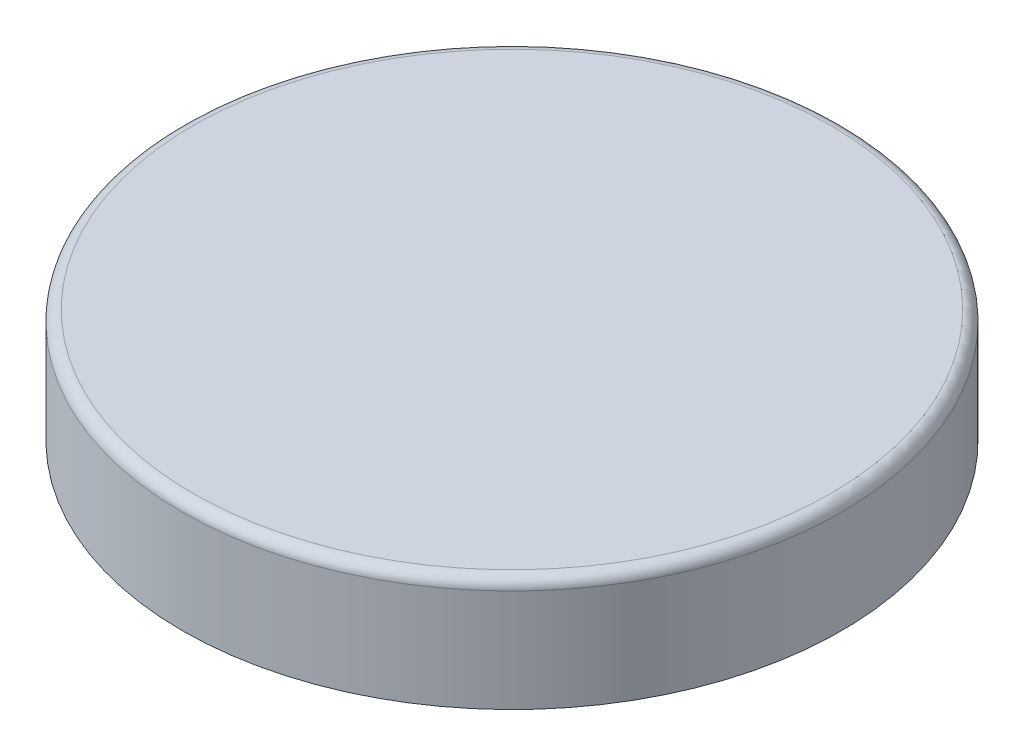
ISO-10303-21;
HEADER;
FILE_DESCRIPTION(('STEP AP214'),'2;1');
FILE_NAME('part.step','',(''),(''),'','','');
FILE_SCHEMA(('AUTOMOTIVE_DESIGN { 1 0 10303 214 1 1 1 1 }'));
ENDSEC;
DATA;
#1=APPLICATION_CONTEXT('core data for automotive mechanical design processes');
#2=APPLICATION_PROTOCOL_DEFINITION('international standard','automotive_design',2000,#1);
#3=PRODUCT_CONTEXT('',#1,'mechanical');
#4=PRODUCT('Part','Part','',(#3));
#5=PRODUCT_RELATED_PRODUCT_CATEGORY('part','',(#4));
#6=PRODUCT_DEFINITION_FORMATION('','',#4);
#7=PRODUCT_DEFINITION_CONTEXT('part definition',#1,'design');
#8=PRODUCT_DEFINITION('design','',#6,#7);
#9=PRODUCT_DEFINITION_SHAPE('','',#8);
#10=(LENGTH_UNIT() NAMED_UNIT(*) SI_UNIT(.MILLI.,.METRE.));
#11=(NAMED_UNIT(*) PLANE_ANGLE_UNIT() SI_UNIT($,.RADIAN.));
#12=(NAMED_UNIT(*) SI_UNIT($,.STERADIAN.) SOLID_ANGLE_UNIT());
#13=UNCERTAINTY_MEASURE_WITH_UNIT(LENGTH_MEASURE(1.E-05),#10,'distance_accuracy_value','');
#14=(GEOMETRIC_REPRESENTATION_CONTEXT(3) GLOBAL_UNCERTAINTY_ASSIGNED_CONTEXT((#13)) GLOBAL_UNIT_ASSIGNED_CONTEXT((#10,
#11,#12)) REPRESENTATION_CONTEXT('',''));
#15=CARTESIAN_POINT('',(0.,0.,0.));
#16=DIRECTION('',(0.,0.,1.));
#17=DIRECTION('',(1.,0.,0.));
#18=AXIS2_PLACEMENT_3D('',#15,#16,#17);
#19=CARTESIAN_POINT('',(0.,11.75,0.));
#20=DIRECTION('',(0.,-1.,0.));
#21=DIRECTION('',(0.,0.,-1.));
#22=AXIS2_PLACEMENT_3D('',#19,#20,#21);
#23=CONICAL_SURFACE('',#22,1.5,1.0471975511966);
#24=CARTESIAN_POINT('',(0.,11.75,0.));
#25=DIRECTION('',(0.,-1.,0.));
#26=DIRECTION('',(0.,0.,-1.));
#27=AXIS2_PLACEMENT_3D('',#24,#25,#26);
#28=CIRCLE('',#27,1.5);
#29=CARTESIAN_POINT('',(0.,11.75,-1.5));
#30=VERTEX_POINT('',#29);
#31=EDGE_CURVE('E76',#30,#30,#28,.T.);
#32=ORIENTED_EDGE('',*,*,#31,.T.);
#33=EDGE_LOOP('',(#32));
#34=FACE_BOUND('',#33,.T.);
#35=CARTESIAN_POINT('',(0.,11.525,0.));
#36=DIRECTION('',(0.,-1.,0.));
#37=DIRECTION('',(0.,0.,-1.));
#38=AXIS2_PLACEMENT_3D('',#35,#36,#37);
#39=CIRCLE('',#38,1.889711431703);
#40=CARTESIAN_POINT('',(0.,11.525,-1.889711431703));
#41=VERTEX_POINT('',#40);
#42=EDGE_CURVE('E73',#41,#41,#39,.T.);
#43=ORIENTED_EDGE('',*,*,#42,.F.);
#44=EDGE_LOOP('',(#43));
#45=FACE_BOUND('',#44,.T.);
#46=ADVANCED_FACE('F39',(#34,#45),#23,.T.);
#47=CARTESIAN_POINT('',(0.,12.0386751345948,0.));
#48=DIRECTION('',(0.,1.,0.));
#49=DIRECTION('',(0.,0.,1.));
#50=AXIS2_PLACEMENT_3D('',#47,#48,#49);
#51=CONICAL_SURFACE('',#50,2.,1.0471975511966);
#52=CARTESIAN_POINT('',(0.,11.975,0.));
#53=DIRECTION('',(0.,-1.,0.));
#54=DIRECTION('',(0.,0.,-1.));
#55=AXIS2_PLACEMENT_3D('',#52,#53,#54);
#56=CIRCLE('',#55,1.889711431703);
#57=CARTESIAN_POINT('',(0.,11.975,-1.889711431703));
#58=VERTEX_POINT('',#57);
#59=EDGE_CURVE('E77',#58,#58,#56,.T.);
#60=ORIENTED_EDGE('',*,*,#59,.T.);
#61=EDGE_LOOP('',(#60));
#62=FACE_BOUND('',#61,.T.);
#63=ORIENTED_EDGE('',*,*,#31,.F.);
#64=EDGE_LOOP('',(#63));
#65=FACE_BOUND('',#64,.T.);
#66=ADVANCED_FACE('F226',(#62,#65),#51,.T.);
#67=CARTESIAN_POINT('',(0.,9.5,0.));
#68=DIRECTION('',(0.,-1.,0.));
#69=DIRECTION('',(0.,0.,-1.));
#70=AXIS2_PLACEMENT_3D('',#67,#68,#69);
#71=PLANE('',#70);
#72=CARTESIAN_POINT('',(0.,9.5,0.));
#73=DIRECTION('',(0.,-1.,0.));
#74=DIRECTION('',(0.,0.,-1.));
#75=AXIS2_PLACEMENT_3D('',#72,#73,#74);
#76=CIRCLE('',#75,1.5);
#77=CARTESIAN_POINT('',(0.,9.5,-1.5));
#78=VERTEX_POINT('',#77);
#79=EDGE_CURVE('E59',#78,#78,#76,.T.);
#80=ORIENTED_EDGE('',*,*,#79,.T.);
#81=EDGE_LOOP('',(#80));
#82=FACE_BOUND('',#81,.T.);
#83=ADVANCED_FACE('F233',(#82),#71,.T.);
#84=CARTESIAN_POINT('',(0.,9.78867513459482,0.));
#85=DIRECTION('',(0.,1.,0.));
#86=DIRECTION('',(0.,0.,1.));
#87=AXIS2_PLACEMENT_3D('',#84,#85,#86);
#88=CONICAL_SURFACE('',#87,2.,1.0471975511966);
#89=CARTESIAN_POINT('',(0.,9.725,0.));
#90=DIRECTION('',(0.,-1.,0.));
#91=DIRECTION('',(0.,0.,-1.));
#92=AXIS2_PLACEMENT_3D('',#89,#90,#91);
#93=CIRCLE('',#92,1.889711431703);
#94=CARTESIAN_POINT('',(0.,9.725,-1.889711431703));
#95=VERTEX_POINT('',#94);
#96=EDGE_CURVE('E56',#95,#95,#93,.T.);
#97=ORIENTED_EDGE('',*,*,#96,.T.);
#98=EDGE_LOOP('',(#97));
#99=FACE_BOUND('',#98,.T.);
#100=ORIENTED_EDGE('',*,*,#79,.F.);
#101=EDGE_LOOP('',(#100));
#102=FACE_BOUND('',#101,.T.);
#103=ADVANCED_FACE('F271',(#99,#102),#88,.T.);
#104=CARTESIAN_POINT('',(0.,9.95,0.));
#105=DIRECTION('',(0.,-1.,0.));
#106=DIRECTION('',(0.,0.,-1.));
#107=AXIS2_PLACEMENT_3D('',#104,#105,#106);
#108=CONICAL_SURFACE('',#107,1.5,1.0471975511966);
#109=CARTESIAN_POINT('',(0.,9.95,0.));
#110=DIRECTION('',(0.,-1.,0.));
#111=DIRECTION('',(0.,0.,-1.));
#112=AXIS2_PLACEMENT_3D('',#109,#110,#111);
#113=CIRCLE('',#112,1.5);
#114=CARTESIAN_POINT('',(0.,9.95,-1.5));
#115=VERTEX_POINT('',#114);
#116=EDGE_CURVE('E60',#115,#115,#113,.T.);
#117=ORIENTED_EDGE('',*,*,#116,.T.);
#118=EDGE_LOOP('',(#117));
#119=FACE_BOUND('',#118,.T.);
#120=ORIENTED_EDGE('',*,*,#96,.F.);
#121=EDGE_LOOP('',(#120));
#122=FACE_BOUND('',#121,.T.);
#123=ADVANCED_FACE('F267',(#119,#122),#108,.T.);
#124=CARTESIAN_POINT('',(0.,10.2386751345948,0.));
#125=DIRECTION('',(0.,1.,0.));
#126=DIRECTION('',(0.,0.,1.));
#127=AXIS2_PLACEMENT_3D('',#124,#125,#126);
#128=CONICAL_SURFACE('',#127,2.,1.0471975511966);
#129=CARTESIAN_POINT('',(0.,10.175,0.));
#130=DIRECTION('',(0.,-1.,0.));
#131=DIRECTION('',(0.,0.,-1.));
#132=AXIS2_PLACEMENT_3D('',#129,#130,#131);
#133=CIRCLE('',#132,1.889711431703);
#134=CARTESIAN_POINT('',(0.,10.175,-1.889711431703));
#135=VERTEX_POINT('',#134);
#136=EDGE_CURVE('E61',#135,#135,#133,.T.);
#137=ORIENTED_EDGE('',*,*,#136,.T.);
#138=EDGE_LOOP('',(#137));
#139=FACE_BOUND('',#138,.T.);
#140=ORIENTED_EDGE('',*,*,#116,.F.);
#141=EDGE_LOOP('',(#140));
#142=FACE_BOUND('',#141,.T.);
#143=ADVANCED_FACE('F263',(#139,#142),#128,.T.);
#144=CARTESIAN_POINT('',(0.,10.4,0.));
#145=DIRECTION('',(0.,-1.,0.));
#146=DIRECTION('',(0.,0.,-1.));
#147=AXIS2_PLACEMENT_3D('',#144,#145,#146);
#148=CONICAL_SURFACE('',#147,1.5,1.0471975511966);
#149=CARTESIAN_POINT('',(0.,10.4,0.));
#150=DIRECTION('',(0.,-1.,0.));
#151=DIRECTION('',(0.,0.,-1.));
#152=AXIS2_PLACEMENT_3D('',#149,#150,#151);
#153=CIRCLE('',#152,1.5);
#154=CARTESIAN_POINT('',(0.,10.4,-1.5));
#155=VERTEX_POINT('',#154);
#156=EDGE_CURVE('E64',#155,#155,#153,.T.);
#157=ORIENTED_EDGE('',*,*,#156,.T.);
#158=EDGE_LOOP('',(#157));
#159=FACE_BOUND('',#158,.T.);
#160=ORIENTED_EDGE('',*,*,#136,.F.);
#161=EDGE_LOOP('',(#160));
#162=FACE_BOUND('',#161,.T.);
#163=ADVANCED_FACE('F259',(#159,#162),#148,.T.);
#164=CARTESIAN_POINT('',(0.,10.6886751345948,0.));
#165=DIRECTION('',(0.,1.,0.));
#166=DIRECTION('',(0.,0.,1.));
#167=AXIS2_PLACEMENT_3D('',#164,#165,#166);
#168=CONICAL_SURFACE('',#167,2.,1.0471975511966);
#169=CARTESIAN_POINT('',(0.,10.625,0.));
#170=DIRECTION('',(0.,-1.,0.));
#171=DIRECTION('',(0.,0.,-1.));
#172=AXIS2_PLACEMENT_3D('',#169,#170,#171);
#173=CIRCLE('',#172,1.889711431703);
#174=CARTESIAN_POINT('',(0.,10.625,-1.889711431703));
#175=VERTEX_POINT('',#174);
#176=EDGE_CURVE('E65',#175,#175,#173,.T.);
#177=ORIENTED_EDGE('',*,*,#176,.T.);
#178=EDGE_LOOP('',(#177));
#179=FACE_BOUND('',#178,.T.);
#180=ORIENTED_EDGE('',*,*,#156,.F.);
#181=EDGE_LOOP('',(#180));
#182=FACE_BOUND('',#181,.T.);
#183=ADVANCED_FACE('F255',(#179,#182),#168,.T.);
#184=CARTESIAN_POINT('',(0.,10.85,0.));
#185=DIRECTION('',(0.,-1.,0.));
#186=DIRECTION('',(0.,0.,-1.));
#187=AXIS2_PLACEMENT_3D('',#184,#185,#186);
#188=CONICAL_SURFACE('',#187,1.5,1.0471975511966);
#189=CARTESIAN_POINT('',(0.,10.85,0.));
#190=DIRECTION('',(0.,-1.,0.));
#191=DIRECTION('',(0.,0.,-1.));
#192=AXIS2_PLACEMENT_3D('',#189,#190,#191);
#193=CIRCLE('',#192,1.5);
#194=CARTESIAN_POINT('',(0.,10.85,-1.5));
#195=VERTEX_POINT('',#194);
#196=EDGE_CURVE('E68',#195,#195,#193,.T.);
#197=ORIENTED_EDGE('',*,*,#196,.T.);
#198=EDGE_LOOP('',(#197));
#199=FACE_BOUND('',#198,.T.);
#200=ORIENTED_EDGE('',*,*,#176,.F.);
#201=EDGE_LOOP('',(#200));
#202=FACE_BOUND('',#201,.T.);
#203=ADVANCED_FACE('F251',(#199,#202),#188,.T.);
#204=CARTESIAN_POINT('',(0.,11.1386751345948,0.));
#205=DIRECTION('',(0.,1.,0.));
#206=DIRECTION('',(0.,0.,1.));
#207=AXIS2_PLACEMENT_3D('',#204,#205,#206);
#208=CONICAL_SURFACE('',#207,2.,1.0471975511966);
#209=CARTESIAN_POINT('',(0.,11.075,0.));
#210=DIRECTION('',(0.,-1.,0.));
#211=DIRECTION('',(0.,0.,-1.));
#212=AXIS2_PLACEMENT_3D('',#209,#210,#211);
#213=CIRCLE('',#212,1.889711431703);
#214=CARTESIAN_POINT('',(0.,11.075,-1.889711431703));
#215=VERTEX_POINT('',#214);
#216=EDGE_CURVE('E69',#215,#215,#213,.T.);
#217=ORIENTED_EDGE('',*,*,#216,.T.);
#218=EDGE_LOOP('',(#217));
#219=FACE_BOUND('',#218,.T.);
#220=ORIENTED_EDGE('',*,*,#196,.F.);
#221=EDGE_LOOP('',(#220));
#222=FACE_BOUND('',#221,.T.);
#223=ADVANCED_FACE('F247',(#219,#222),#208,.T.);
#224=CARTESIAN_POINT('',(0.,11.3,0.));
#225=DIRECTION('',(0.,-1.,0.));
#226=DIRECTION('',(0.,0.,-1.));
#227=AXIS2_PLACEMENT_3D('',#224,#225,#226);
#228=CONICAL_SURFACE('',#227,1.5,1.0471975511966);
#229=CARTESIAN_POINT('',(0.,11.3,0.));
#230=DIRECTION('',(0.,-1.,0.));
#231=DIRECTION('',(0.,0.,-1.));
#232=AXIS2_PLACEMENT_3D('',#229,#230,#231);
#233=CIRCLE('',#232,1.5);
#234=CARTESIAN_POINT('',(0.,11.3,-1.5));
#235=VERTEX_POINT('',#234);
#236=EDGE_CURVE('E72',#235,#235,#233,.T.);
#237=ORIENTED_EDGE('',*,*,#236,.T.);
#238=EDGE_LOOP('',(#237));
#239=FACE_BOUND('',#238,.T.);
#240=ORIENTED_EDGE('',*,*,#216,.F.);
#241=EDGE_LOOP('',(#240));
#242=FACE_BOUND('',#241,.T.);
#243=ADVANCED_FACE('F243',(#239,#242),#228,.T.);
#244=CARTESIAN_POINT('',(0.,11.5886751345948,0.));
#245=DIRECTION('',(0.,1.,0.));
#246=DIRECTION('',(0.,0.,1.));
#247=AXIS2_PLACEMENT_3D('',#244,#245,#246);
#248=CONICAL_SURFACE('',#247,2.,1.0471975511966);
#249=ORIENTED_EDGE('',*,*,#42,.T.);
#250=EDGE_LOOP('',(#249));
#251=FACE_BOUND('',#250,.T.);
#252=ORIENTED_EDGE('',*,*,#236,.F.);
#253=EDGE_LOOP('',(#252));
#254=FACE_BOUND('',#253,.T.);
#255=ADVANCED_FACE('F239',(#251,#254),#248,.T.);
#256=CARTESIAN_POINT('',(0.,12.2,0.));
#257=DIRECTION('',(0.,-1.,0.));
#258=DIRECTION('',(0.,0.,-1.));
#259=AXIS2_PLACEMENT_3D('',#256,#257,#258);
#260=CONICAL_SURFACE('',#259,1.5,1.0471975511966);
#261=CARTESIAN_POINT('',(0.,12.2,0.));
#262=DIRECTION('',(0.,-1.,0.));
#263=DIRECTION('',(0.,0.,-1.));
#264=AXIS2_PLACEMENT_3D('',#261,#262,#263);
#265=CIRCLE('',#264,1.5);
#266=CARTESIAN_POINT('',(0.,12.2,-1.5));
#267=VERTEX_POINT('',#266);
#268=EDGE_CURVE('E80',#267,#267,#265,.T.);
#269=ORIENTED_EDGE('',*,*,#268,.T.);
#270=EDGE_LOOP('',(#269));
#271=FACE_BOUND('',#270,.T.);
#272=ORIENTED_EDGE('',*,*,#59,.F.);
#273=EDGE_LOOP('',(#272));
#274=FACE_BOUND('',#273,.T.);
#275=ADVANCED_FACE('F242',(#271,#274),#260,.T.);
#276=CARTESIAN_POINT('',(0.,12.4886751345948,0.));
#277=DIRECTION('',(0.,1.,0.));
#278=DIRECTION('',(0.,0.,1.));
#279=AXIS2_PLACEMENT_3D('',#276,#277,#278);
#280=CONICAL_SURFACE('',#279,2.,1.0471975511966);
#281=CARTESIAN_POINT('',(0.,12.425,0.));
#282=DIRECTION('',(0.,-1.,0.));
#283=DIRECTION('',(0.,0.,-1.));
#284=AXIS2_PLACEMENT_3D('',#281,#282,#283);
#285=CIRCLE('',#284,1.889711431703);
#286=CARTESIAN_POINT('',(0.,12.425,-1.889711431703));
#287=VERTEX_POINT('',#286);
#288=EDGE_CURVE('E81',#287,#287,#285,.T.);
#289=ORIENTED_EDGE('',*,*,#288,.T.);
#290=EDGE_LOOP('',(#289));
#291=FACE_BOUND('',#290,.T.);
#292=ORIENTED_EDGE('',*,*,#268,.F.);
#293=EDGE_LOOP('',(#292));
#294=FACE_BOUND('',#293,.T.);
#295=ADVANCED_FACE('F409',(#291,#294),#280,.T.);
#296=CARTESIAN_POINT('',(0.,12.65,0.));
#297=DIRECTION('',(0.,-1.,0.));
#298=DIRECTION('',(0.,0.,-1.));
#299=AXIS2_PLACEMENT_3D('',#296,#297,#298);
#300=CONICAL_SURFACE('',#299,1.5,1.0471975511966);
#301=CARTESIAN_POINT('',(0.,12.65,0.));
#302=DIRECTION('',(0.,-1.,0.));
#303=DIRECTION('',(0.,0.,-1.));
#304=AXIS2_PLACEMENT_3D('',#301,#302,#303);
#305=CIRCLE('',#304,1.5);
#306=CARTESIAN_POINT('',(0.,12.65,-1.5));
#307=VERTEX_POINT('',#306);
#308=EDGE_CURVE('E84',#307,#307,#305,.T.);
#309=ORIENTED_EDGE('',*,*,#308,.T.);
#310=EDGE_LOOP('',(#309));
#311=FACE_BOUND('',#310,.T.);
#312=ORIENTED_EDGE('',*,*,#288,.F.);
#313=EDGE_LOOP('',(#312));
#314=FACE_BOUND('',#313,.T.);
#315=ADVANCED_FACE('F419',(#311,#314),#300,.T.);
#316=CARTESIAN_POINT('',(0.,12.9386751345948,0.));
#317=DIRECTION('',(0.,1.,0.));
#318=DIRECTION('',(0.,0.,1.));
#319=AXIS2_PLACEMENT_3D('',#316,#317,#318);
#320=CONICAL_SURFACE('',#319,2.,1.0471975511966);
#321=CARTESIAN_POINT('',(0.,12.875,0.));
#322=DIRECTION('',(0.,-1.,0.));
#323=DIRECTION('',(0.,0.,-1.));
#324=AXIS2_PLACEMENT_3D('',#321,#322,#323);
#325=CIRCLE('',#324,1.889711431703);
#326=CARTESIAN_POINT('',(0.,12.875,-1.889711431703));
#327=VERTEX_POINT('',#326);
#328=EDGE_CURVE('E85',#327,#327,#325,.T.);
#329=ORIENTED_EDGE('',*,*,#328,.T.);
#330=EDGE_LOOP('',(#329));
#331=FACE_BOUND('',#330,.T.);
#332=ORIENTED_EDGE('',*,*,#308,.F.);
#333=EDGE_LOOP('',(#332));
#334=FACE_BOUND('',#333,.T.);
#335=ADVANCED_FACE('F430',(#331,#334),#320,.T.);
#336=CARTESIAN_POINT('',(0.,13.1,0.));
#337=DIRECTION('',(0.,-1.,0.));
#338=DIRECTION('',(0.,0.,-1.));
#339=AXIS2_PLACEMENT_3D('',#336,#337,#338);
#340=CONICAL_SURFACE('',#339,1.5,1.0471975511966);
#341=CARTESIAN_POINT('',(0.,13.1,0.));
#342=DIRECTION('',(0.,-1.,0.));
#343=DIRECTION('',(0.,0.,-1.));
#344=AXIS2_PLACEMENT_3D('',#341,#342,#343);
#345=CIRCLE('',#344,1.5);
#346=CARTESIAN_POINT('',(0.,13.1,-1.5));
#347=VERTEX_POINT('',#346);
#348=EDGE_CURVE('E88',#347,#347,#345,.T.);
#349=ORIENTED_EDGE('',*,*,#348,.T.);
#350=EDGE_LOOP('',(#349));
#351=FACE_BOUND('',#350,.T.);
#352=ORIENTED_EDGE('',*,*,#328,.F.);
#353=EDGE_LOOP('',(#352));
#354=FACE_BOUND('',#353,.T.);
#355=ADVANCED_FACE('F441',(#351,#354),#340,.T.);
#356=CARTESIAN_POINT('',(0.,13.3886751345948,0.));
#357=DIRECTION('',(0.,1.,0.));
#358=DIRECTION('',(0.,0.,1.));
#359=AXIS2_PLACEMENT_3D('',#356,#357,#358);
#360=CONICAL_SURFACE('',#359,2.,1.0471975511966);
#361=CARTESIAN_POINT('',(0.,13.325,0.));
#362=DIRECTION('',(0.,-1.,0.));
#363=DIRECTION('',(0.,0.,-1.));
#364=AXIS2_PLACEMENT_3D('',#361,#362,#363);
#365=CIRCLE('',#364,1.889711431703);
#366=CARTESIAN_POINT('',(0.,13.325,-1.889711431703));
#367=VERTEX_POINT('',#366);
#368=EDGE_CURVE('E89',#367,#367,#365,.T.);
#369=ORIENTED_EDGE('',*,*,#368,.T.);
#370=EDGE_LOOP('',(#369));
#371=FACE_BOUND('',#370,.T.);
#372=ORIENTED_EDGE('',*,*,#348,.F.);
#373=EDGE_LOOP('',(#372));
#374=FACE_BOUND('',#373,.T.);
#375=ADVANCED_FACE('F452',(#371,#374),#360,.T.);
#376=CARTESIAN_POINT('',(0.,13.55,0.));
#377=DIRECTION('',(0.,-1.,0.));
#378=DIRECTION('',(0.,0.,-1.));
#379=AXIS2_PLACEMENT_3D('',#376,#377,#378);
#380=CONICAL_SURFACE('',#379,1.5,1.0471975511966);
#381=CARTESIAN_POINT('',(0.,13.55,0.));
#382=DIRECTION('',(0.,-1.,0.));
#383=DIRECTION('',(0.,0.,-1.));
#384=AXIS2_PLACEMENT_3D('',#381,#382,#383);
#385=CIRCLE('',#384,1.5);
#386=CARTESIAN_POINT('',(0.,13.55,-1.5));
#387=VERTEX_POINT('',#386);
#388=EDGE_CURVE('E92',#387,#387,#385,.T.);
#389=ORIENTED_EDGE('',*,*,#388,.T.);
#390=EDGE_LOOP('',(#389));
#391=FACE_BOUND('',#390,.T.);
#392=ORIENTED_EDGE('',*,*,#368,.F.);
#393=EDGE_LOOP('',(#392));
#394=FACE_BOUND('',#393,.T.);
#395=ADVANCED_FACE('F463',(#391,#394),#380,.T.);
#396=CARTESIAN_POINT('',(0.,13.8386751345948,0.));
#397=DIRECTION('',(0.,1.,0.));
#398=DIRECTION('',(0.,0.,1.));
#399=AXIS2_PLACEMENT_3D('',#396,#397,#398);
#400=CONICAL_SURFACE('',#399,2.,1.0471975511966);
#401=CARTESIAN_POINT('',(0.,13.775,0.));
#402=DIRECTION('',(0.,-1.,0.));
#403=DIRECTION('',(0.,0.,-1.));
#404=AXIS2_PLACEMENT_3D('',#401,#402,#403);
#405=CIRCLE('',#404,1.889711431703);
#406=CARTESIAN_POINT('',(0.,13.775,-1.889711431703));
#407=VERTEX_POINT('',#406);
#408=EDGE_CURVE('E93',#407,#407,#405,.T.);
#409=ORIENTED_EDGE('',*,*,#408,.T.);
#410=EDGE_LOOP('',(#409));
#411=FACE_BOUND('',#410,.T.);
#412=ORIENTED_EDGE('',*,*,#388,.F.);
#413=EDGE_LOOP('',(#412));
#414=FACE_BOUND('',#413,.T.);
#415=ADVANCED_FACE('F474',(#411,#414),#400,.T.);
#416=CARTESIAN_POINT('',(0.,14.,0.));
#417=DIRECTION('',(0.,-1.,0.));
#418=DIRECTION('',(0.,0.,-1.));
#419=AXIS2_PLACEMENT_3D('',#416,#417,#418);
#420=CONICAL_SURFACE('',#419,1.5,1.0471975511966);
#421=CARTESIAN_POINT('',(0.,14.,0.));
#422=DIRECTION('',(0.,-1.,0.));
#423=DIRECTION('',(0.,0.,-1.));
#424=AXIS2_PLACEMENT_3D('',#421,#422,#423);
#425=CIRCLE('',#424,1.5);
#426=CARTESIAN_POINT('',(0.,14.,-1.5));
#427=VERTEX_POINT('',#426);
#428=EDGE_CURVE('E96',#427,#427,#425,.T.);
#429=ORIENTED_EDGE('',*,*,#428,.T.);
#430=EDGE_LOOP('',(#429));
#431=FACE_BOUND('',#430,.T.);
#432=ORIENTED_EDGE('',*,*,#408,.F.);
#433=EDGE_LOOP('',(#432));
#434=FACE_BOUND('',#433,.T.);
#435=ADVANCED_FACE('F485',(#431,#434),#420,.T.);
#436=CARTESIAN_POINT('',(0.,14.2886751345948,0.));
#437=DIRECTION('',(0.,1.,0.));
#438=DIRECTION('',(0.,0.,1.));
#439=AXIS2_PLACEMENT_3D('',#436,#437,#438);
#440=CONICAL_SURFACE('',#439,2.,1.0471975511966);
#441=CARTESIAN_POINT('',(0.,14.225,0.));
#442=DIRECTION('',(0.,-1.,0.));
#443=DIRECTION('',(0.,0.,-1.));
#444=AXIS2_PLACEMENT_3D('',#441,#442,#443);
#445=CIRCLE('',#444,1.889711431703);
#446=CARTESIAN_POINT('',(0.,14.225,-1.889711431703));
#447=VERTEX_POINT('',#446);
#448=EDGE_CURVE('E97',#447,#447,#445,.T.);
#449=ORIENTED_EDGE('',*,*,#448,.T.);
#450=EDGE_LOOP('',(#449));
#451=FACE_BOUND('',#450,.T.);
#452=ORIENTED_EDGE('',*,*,#428,.F.);
#453=EDGE_LOOP('',(#452));
#454=FACE_BOUND('',#453,.T.);
#455=ADVANCED_FACE('F496',(#451,#454),#440,.T.);
#456=CARTESIAN_POINT('',(0.,14.45,0.));
#457=DIRECTION('',(0.,-1.,0.));
#458=DIRECTION('',(0.,0.,-1.));
#459=AXIS2_PLACEMENT_3D('',#456,#457,#458);
#460=CONICAL_SURFACE('',#459,1.5,1.0471975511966);
#461=CARTESIAN_POINT('',(0.,14.45,0.));
#462=DIRECTION('',(0.,-1.,0.));
#463=DIRECTION('',(0.,0.,-1.));
#464=AXIS2_PLACEMENT_3D('',#461,#462,#463);
#465=CIRCLE('',#464,1.5);
#466=CARTESIAN_POINT('',(0.,14.45,-1.5));
#467=VERTEX_POINT('',#466);
#468=EDGE_CURVE('E100',#467,#467,#465,.T.);
#469=ORIENTED_EDGE('',*,*,#468,.T.);
#470=EDGE_LOOP('',(#469));
#471=FACE_BOUND('',#470,.T.);
#472=ORIENTED_EDGE('',*,*,#448,.F.);
#473=EDGE_LOOP('',(#472));
#474=FACE_BOUND('',#473,.T.);
#475=ADVANCED_FACE('F507',(#471,#474),#460,.T.);
#476=CARTESIAN_POINT('',(0.,14.7386751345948,0.));
#477=DIRECTION('',(0.,1.,0.));
#478=DIRECTION('',(0.,0.,1.));
#479=AXIS2_PLACEMENT_3D('',#476,#477,#478);
#480=CONICAL_SURFACE('',#479,2.,1.0471975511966);
#481=CARTESIAN_POINT('',(0.,14.675,0.));
#482=DIRECTION('',(0.,-1.,0.));
#483=DIRECTION('',(0.,0.,-1.));
#484=AXIS2_PLACEMENT_3D('',#481,#482,#483);
#485=CIRCLE('',#484,1.889711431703);
#486=CARTESIAN_POINT('',(0.,14.675,-1.889711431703));
#487=VERTEX_POINT('',#486);
#488=EDGE_CURVE('E101',#487,#487,#485,.T.);
#489=ORIENTED_EDGE('',*,*,#488,.T.);
#490=EDGE_LOOP('',(#489));
#491=FACE_BOUND('',#490,.T.);
#492=ORIENTED_EDGE('',*,*,#468,.F.);
#493=EDGE_LOOP('',(#492));
#494=FACE_BOUND('',#493,.T.);
#495=ADVANCED_FACE('F518',(#491,#494),#480,.T.);
#496=CARTESIAN_POINT('',(0.,14.9,0.));
#497=DIRECTION('',(0.,-1.,0.));
#498=DIRECTION('',(0.,0.,-1.));
#499=AXIS2_PLACEMENT_3D('',#496,#497,#498);
#500=CONICAL_SURFACE('',#499,1.5,1.0471975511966);
#501=CARTESIAN_POINT('',(0.,14.9,0.));
#502=DIRECTION('',(0.,-1.,0.));
#503=DIRECTION('',(0.,0.,-1.));
#504=AXIS2_PLACEMENT_3D('',#501,#502,#503);
#505=CIRCLE('',#504,1.5);
#506=CARTESIAN_POINT('',(0.,14.9,-1.5));
#507=VERTEX_POINT('',#506);
#508=EDGE_CURVE('E104',#507,#507,#505,.T.);
#509=ORIENTED_EDGE('',*,*,#508,.T.);
#510=EDGE_LOOP('',(#509));
#511=FACE_BOUND('',#510,.T.);
#512=ORIENTED_EDGE('',*,*,#488,.F.);
#513=EDGE_LOOP('',(#512));
#514=FACE_BOUND('',#513,.T.);
#515=ADVANCED_FACE('F529',(#511,#514),#500,.T.);
#516=CARTESIAN_POINT('',(0.,15.1886751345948,0.));
#517=DIRECTION('',(0.,1.,0.));
#518=DIRECTION('',(0.,0.,1.));
#519=AXIS2_PLACEMENT_3D('',#516,#517,#518);
#520=CONICAL_SURFACE('',#519,2.,1.0471975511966);
#521=CARTESIAN_POINT('',(0.,15.125,0.));
#522=DIRECTION('',(0.,-1.,0.));
#523=DIRECTION('',(0.,0.,-1.));
#524=AXIS2_PLACEMENT_3D('',#521,#522,#523);
#525=CIRCLE('',#524,1.889711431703);
#526=CARTESIAN_POINT('',(0.,15.125,-1.889711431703));
#527=VERTEX_POINT('',#526);
#528=EDGE_CURVE('E105',#527,#527,#525,.T.);
#529=ORIENTED_EDGE('',*,*,#528,.T.);
#530=EDGE_LOOP('',(#529));
#531=FACE_BOUND('',#530,.T.);
#532=ORIENTED_EDGE('',*,*,#508,.F.);
#533=EDGE_LOOP('',(#532));
#534=FACE_BOUND('',#533,.T.);
#535=ADVANCED_FACE('F540',(#531,#534),#520,.T.);
#536=CARTESIAN_POINT('',(0.,15.35,0.));
#537=DIRECTION('',(0.,-1.,0.));
#538=DIRECTION('',(0.,0.,-1.));
#539=AXIS2_PLACEMENT_3D('',#536,#537,#538);
#540=CONICAL_SURFACE('',#539,1.5,1.0471975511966);
#541=CARTESIAN_POINT('',(0.,15.35,0.));
#542=DIRECTION('',(0.,-1.,0.));
#543=DIRECTION('',(0.,0.,-1.));
#544=AXIS2_PLACEMENT_3D('',#541,#542,#543);
#545=CIRCLE('',#544,1.5);
#546=CARTESIAN_POINT('',(0.,15.35,-1.5));
#547=VERTEX_POINT('',#546);
#548=EDGE_CURVE('E108',#547,#547,#545,.T.);
#549=ORIENTED_EDGE('',*,*,#548,.T.);
#550=EDGE_LOOP('',(#549));
#551=FACE_BOUND('',#550,.T.);
#552=ORIENTED_EDGE('',*,*,#528,.F.);
#553=EDGE_LOOP('',(#552));
#554=FACE_BOUND('',#553,.T.);
#555=ADVANCED_FACE('F551',(#551,#554),#540,.T.);
#556=CARTESIAN_POINT('',(0.,15.6386751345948,0.));
#557=DIRECTION('',(0.,1.,0.));
#558=DIRECTION('',(0.,0.,1.));
#559=AXIS2_PLACEMENT_3D('',#556,#557,#558);
#560=CONICAL_SURFACE('',#559,2.,1.0471975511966);
#561=CARTESIAN_POINT('',(0.,15.575,0.));
#562=DIRECTION('',(0.,-1.,0.));
#563=DIRECTION('',(0.,0.,-1.));
#564=AXIS2_PLACEMENT_3D('',#561,#562,#563);
#565=CIRCLE('',#564,1.889711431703);
#566=CARTESIAN_POINT('',(0.,15.575,-1.889711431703));
#567=VERTEX_POINT('',#566);
#568=EDGE_CURVE('E109',#567,#567,#565,.T.);
#569=ORIENTED_EDGE('',*,*,#568,.T.);
#570=EDGE_LOOP('',(#569));
#571=FACE_BOUND('',#570,.T.);
#572=ORIENTED_EDGE('',*,*,#548,.F.);
#573=EDGE_LOOP('',(#572));
#574=FACE_BOUND('',#573,.T.);
#575=ADVANCED_FACE('F562',(#571,#574),#560,.T.);
#576=CARTESIAN_POINT('',(0.,15.8,0.));
#577=DIRECTION('',(0.,-1.,0.));
#578=DIRECTION('',(0.,0.,-1.));
#579=AXIS2_PLACEMENT_3D('',#576,#577,#578);
#580=CONICAL_SURFACE('',#579,1.5,1.0471975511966);
#581=CARTESIAN_POINT('',(0.,15.8,0.));
#582=DIRECTION('',(0.,-1.,0.));
#583=DIRECTION('',(0.,0.,-1.));
#584=AXIS2_PLACEMENT_3D('',#581,#582,#583);
#585=CIRCLE('',#584,1.5);
#586=CARTESIAN_POINT('',(0.,15.8,-1.5));
#587=VERTEX_POINT('',#586);
#588=EDGE_CURVE('E112',#587,#587,#585,.T.);
#589=ORIENTED_EDGE('',*,*,#588,.T.);
#590=EDGE_LOOP('',(#589));
#591=FACE_BOUND('',#590,.T.);
#592=ORIENTED_EDGE('',*,*,#568,.F.);
#593=EDGE_LOOP('',(#592));
#594=FACE_BOUND('',#593,.T.);
#595=ADVANCED_FACE('F573',(#591,#594),#580,.T.);
#596=CARTESIAN_POINT('',(0.,16.0886751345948,0.));
#597=DIRECTION('',(0.,1.,0.));
#598=DIRECTION('',(0.,0.,1.));
#599=AXIS2_PLACEMENT_3D('',#596,#597,#598);
#600=CONICAL_SURFACE('',#599,2.,1.0471975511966);
#601=CARTESIAN_POINT('',(0.,16.025,0.));
#602=DIRECTION('',(0.,-1.,0.));
#603=DIRECTION('',(0.,0.,-1.));
#604=AXIS2_PLACEMENT_3D('',#601,#602,#603);
#605=CIRCLE('',#604,1.889711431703);
#606=CARTESIAN_POINT('',(0.,16.025,-1.889711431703));
#607=VERTEX_POINT('',#606);
#608=EDGE_CURVE('E113',#607,#607,#605,.T.);
#609=ORIENTED_EDGE('',*,*,#608,.T.);
#610=EDGE_LOOP('',(#609));
#611=FACE_BOUND('',#610,.T.);
#612=ORIENTED_EDGE('',*,*,#588,.F.);
#613=EDGE_LOOP('',(#612));
#614=FACE_BOUND('',#613,.T.);
#615=ADVANCED_FACE('F584',(#611,#614),#600,.T.);
#616=CARTESIAN_POINT('',(0.,16.25,0.));
#617=DIRECTION('',(0.,-1.,0.));
#618=DIRECTION('',(0.,0.,-1.));
#619=AXIS2_PLACEMENT_3D('',#616,#617,#618);
#620=CONICAL_SURFACE('',#619,1.5,1.0471975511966);
#621=CARTESIAN_POINT('',(0.,16.25,0.));
#622=DIRECTION('',(0.,-1.,0.));
#623=DIRECTION('',(0.,0.,-1.));
#624=AXIS2_PLACEMENT_3D('',#621,#622,#623);
#625=CIRCLE('',#624,1.5);
#626=CARTESIAN_POINT('',(0.,16.25,-1.5));
#627=VERTEX_POINT('',#626);
#628=EDGE_CURVE('E116',#627,#627,#625,.T.);
#629=ORIENTED_EDGE('',*,*,#628,.T.);
#630=EDGE_LOOP('',(#629));
#631=FACE_BOUND('',#630,.T.);
#632=ORIENTED_EDGE('',*,*,#608,.F.);
#633=EDGE_LOOP('',(#632));
#634=FACE_BOUND('',#633,.T.);
#635=ADVANCED_FACE('F595',(#631,#634),#620,.T.);
#636=CARTESIAN_POINT('',(0.,16.5386751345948,0.));
#637=DIRECTION('',(0.,1.,0.));
#638=DIRECTION('',(0.,0.,1.));
#639=AXIS2_PLACEMENT_3D('',#636,#637,#638);
#640=CONICAL_SURFACE('',#639,2.,1.0471975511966);
#641=CARTESIAN_POINT('',(0.,16.475,0.));
#642=DIRECTION('',(0.,-1.,0.));
#643=DIRECTION('',(0.,0.,-1.));
#644=AXIS2_PLACEMENT_3D('',#641,#642,#643);
#645=CIRCLE('',#644,1.889711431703);
#646=CARTESIAN_POINT('',(0.,16.475,-1.889711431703));
#647=VERTEX_POINT('',#646);
#648=EDGE_CURVE('E117',#647,#647,#645,.T.);
#649=ORIENTED_EDGE('',*,*,#648,.T.);
#650=EDGE_LOOP('',(#649));
#651=FACE_BOUND('',#650,.T.);
#652=ORIENTED_EDGE('',*,*,#628,.F.);
#653=EDGE_LOOP('',(#652));
#654=FACE_BOUND('',#653,.T.);
#655=ADVANCED_FACE('F606',(#651,#654),#640,.T.);
#656=CARTESIAN_POINT('',(0.,16.7,0.));
#657=DIRECTION('',(0.,-1.,0.));
#658=DIRECTION('',(0.,0.,-1.));
#659=AXIS2_PLACEMENT_3D('',#656,#657,#658);
#660=CONICAL_SURFACE('',#659,1.5,1.0471975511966);
#661=CARTESIAN_POINT('',(0.,16.7,0.));
#662=DIRECTION('',(0.,-1.,0.));
#663=DIRECTION('',(0.,0.,-1.));
#664=AXIS2_PLACEMENT_3D('',#661,#662,#663);
#665=CIRCLE('',#664,1.5);
#666=CARTESIAN_POINT('',(0.,16.7,-1.5));
#667=VERTEX_POINT('',#666);
#668=EDGE_CURVE('E120',#667,#667,#665,.T.);
#669=ORIENTED_EDGE('',*,*,#668,.T.);
#670=EDGE_LOOP('',(#669));
#671=FACE_BOUND('',#670,.T.);
#672=ORIENTED_EDGE('',*,*,#648,.F.);
#673=EDGE_LOOP('',(#672));
#674=FACE_BOUND('',#673,.T.);
#675=ADVANCED_FACE('F617',(#671,#674),#660,.T.);
#676=CARTESIAN_POINT('',(0.,16.9886751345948,0.));
#677=DIRECTION('',(0.,1.,0.));
#678=DIRECTION('',(0.,0.,1.));
#679=AXIS2_PLACEMENT_3D('',#676,#677,#678);
#680=CONICAL_SURFACE('',#679,2.,1.0471975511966);
#681=CARTESIAN_POINT('',(0.,16.925,0.));
#682=DIRECTION('',(0.,-1.,0.));
#683=DIRECTION('',(0.,0.,-1.));
#684=AXIS2_PLACEMENT_3D('',#681,#682,#683);
#685=CIRCLE('',#684,1.889711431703);
#686=CARTESIAN_POINT('',(0.,16.925,-1.889711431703));
#687=VERTEX_POINT('',#686);
#688=EDGE_CURVE('E121',#687,#687,#685,.T.);
#689=ORIENTED_EDGE('',*,*,#688,.T.);
#690=EDGE_LOOP('',(#689));
#691=FACE_BOUND('',#690,.T.);
#692=ORIENTED_EDGE('',*,*,#668,.F.);
#693=EDGE_LOOP('',(#692));
#694=FACE_BOUND('',#693,.T.);
#695=ADVANCED_FACE('F628',(#691,#694),#680,.T.);
#696=CARTESIAN_POINT('',(0.,17.15,0.));
#697=DIRECTION('',(0.,-1.,0.));
#698=DIRECTION('',(0.,0.,-1.));
#699=AXIS2_PLACEMENT_3D('',#696,#697,#698);
#700=CONICAL_SURFACE('',#699,1.5,1.0471975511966);
#701=CARTESIAN_POINT('',(0.,17.15,0.));
#702=DIRECTION('',(0.,-1.,0.));
#703=DIRECTION('',(0.,0.,-1.));
#704=AXIS2_PLACEMENT_3D('',#701,#702,#703);
#705=CIRCLE('',#704,1.5);
#706=CARTESIAN_POINT('',(0.,17.15,-1.5));
#707=VERTEX_POINT('',#706);
#708=EDGE_CURVE('E124',#707,#707,#705,.T.);
#709=ORIENTED_EDGE('',*,*,#708,.T.);
#710=EDGE_LOOP('',(#709));
#711=FACE_BOUND('',#710,.T.);
#712=ORIENTED_EDGE('',*,*,#688,.F.);
#713=EDGE_LOOP('',(#712));
#714=FACE_BOUND('',#713,.T.);
#715=ADVANCED_FACE('F639',(#711,#714),#700,.T.);
#716=CARTESIAN_POINT('',(0.,17.4386751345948,0.));
#717=DIRECTION('',(0.,1.,0.));
#718=DIRECTION('',(0.,0.,1.));
#719=AXIS2_PLACEMENT_3D('',#716,#717,#718);
#720=CONICAL_SURFACE('',#719,2.,1.0471975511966);
#721=CARTESIAN_POINT('',(0.,17.375,0.));
#722=DIRECTION('',(0.,-1.,0.));
#723=DIRECTION('',(0.,0.,-1.));
#724=AXIS2_PLACEMENT_3D('',#721,#722,#723);
#725=CIRCLE('',#724,1.889711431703);
#726=CARTESIAN_POINT('',(0.,17.375,-1.889711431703));
#727=VERTEX_POINT('',#726);
#728=EDGE_CURVE('E125',#727,#727,#725,.T.);
#729=ORIENTED_EDGE('',*,*,#728,.T.);
#730=EDGE_LOOP('',(#729));
#731=FACE_BOUND('',#730,.T.);
#732=ORIENTED_EDGE('',*,*,#708,.F.);
#733=EDGE_LOOP('',(#732));
#734=FACE_BOUND('',#733,.T.);
#735=ADVANCED_FACE('F650',(#731,#734),#720,.T.);
#736=CARTESIAN_POINT('',(0.,17.6,0.));
#737=DIRECTION('',(0.,-1.,0.));
#738=DIRECTION('',(0.,0.,-1.));
#739=AXIS2_PLACEMENT_3D('',#736,#737,#738);
#740=CONICAL_SURFACE('',#739,1.5,1.0471975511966);
#741=CARTESIAN_POINT('',(0.,17.6,0.));
#742=DIRECTION('',(0.,-1.,0.));
#743=DIRECTION('',(0.,0.,-1.));
#744=AXIS2_PLACEMENT_3D('',#741,#742,#743);
#745=CIRCLE('',#744,1.5);
#746=CARTESIAN_POINT('',(0.,17.6,-1.5));
#747=VERTEX_POINT('',#746);
#748=EDGE_CURVE('E128',#747,#747,#745,.T.);
#749=ORIENTED_EDGE('',*,*,#748,.T.);
#750=EDGE_LOOP('',(#749));
#751=FACE_BOUND('',#750,.T.);
#752=ORIENTED_EDGE('',*,*,#728,.F.);
#753=EDGE_LOOP('',(#752));
#754=FACE_BOUND('',#753,.T.);
#755=ADVANCED_FACE('F661',(#751,#754),#740,.T.);
#756=CARTESIAN_POINT('',(0.,17.8886751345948,0.));
#757=DIRECTION('',(0.,1.,0.));
#758=DIRECTION('',(0.,0.,1.));
#759=AXIS2_PLACEMENT_3D('',#756,#757,#758);
#760=CONICAL_SURFACE('',#759,2.,1.0471975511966);
#761=CARTESIAN_POINT('',(0.,17.825,0.));
#762=DIRECTION('',(0.,-1.,0.));
#763=DIRECTION('',(0.,0.,-1.));
#764=AXIS2_PLACEMENT_3D('',#761,#762,#763);
#765=CIRCLE('',#764,1.889711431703);
#766=CARTESIAN_POINT('',(0.,17.825,-1.889711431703));
#767=VERTEX_POINT('',#766);
#768=EDGE_CURVE('E129',#767,#767,#765,.T.);
#769=ORIENTED_EDGE('',*,*,#768,.T.);
#770=EDGE_LOOP('',(#769));
#771=FACE_BOUND('',#770,.T.);
#772=ORIENTED_EDGE('',*,*,#748,.F.);
#773=EDGE_LOOP('',(#772));
#774=FACE_BOUND('',#773,.T.);
#775=ADVANCED_FACE('F672',(#771,#774),#760,.T.);
#776=CARTESIAN_POINT('',(0.,18.05,0.));
#777=DIRECTION('',(0.,-1.,0.));
#778=DIRECTION('',(0.,0.,-1.));
#779=AXIS2_PLACEMENT_3D('',#776,#777,#778);
#780=CONICAL_SURFACE('',#779,1.5,1.0471975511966);
#781=CARTESIAN_POINT('',(0.,18.05,0.));
#782=DIRECTION('',(0.,-1.,0.));
#783=DIRECTION('',(0.,0.,-1.));
#784=AXIS2_PLACEMENT_3D('',#781,#782,#783);
#785=CIRCLE('',#784,1.5);
#786=CARTESIAN_POINT('',(0.,18.05,-1.5));
#787=VERTEX_POINT('',#786);
#788=EDGE_CURVE('E131',#787,#787,#785,.T.);
#789=ORIENTED_EDGE('',*,*,#788,.T.);
#790=EDGE_LOOP('',(#789));
#791=FACE_BOUND('',#790,.T.);
#792=ORIENTED_EDGE('',*,*,#768,.F.);
#793=EDGE_LOOP('',(#792));
#794=FACE_BOUND('',#793,.T.);
#795=ADVANCED_FACE('F683',(#791,#794),#780,.T.);
#796=CARTESIAN_POINT('',(0.,18.3386751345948,0.));
#797=DIRECTION('',(0.,1.,0.));
#798=DIRECTION('',(0.,0.,1.));
#799=AXIS2_PLACEMENT_3D('',#796,#797,#798);
#800=CONICAL_SURFACE('',#799,2.,1.0471975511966);
#801=CARTESIAN_POINT('',(0.,18.275,0.));
#802=DIRECTION('',(0.,-1.,0.));
#803=DIRECTION('',(0.,0.,-1.));
#804=AXIS2_PLACEMENT_3D('',#801,#802,#803);
#805=CIRCLE('',#804,1.889711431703);
#806=CARTESIAN_POINT('',(0.,18.275,-1.889711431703));
#807=VERTEX_POINT('',#806);
#808=EDGE_CURVE('E132',#807,#807,#805,.T.);
#809=ORIENTED_EDGE('',*,*,#808,.T.);
#810=EDGE_LOOP('',(#809));
#811=FACE_BOUND('',#810,.T.);
#812=ORIENTED_EDGE('',*,*,#788,.F.);
#813=EDGE_LOOP('',(#812));
#814=FACE_BOUND('',#813,.T.);
#815=ADVANCED_FACE('F694',(#811,#814),#800,.T.);
#816=CARTESIAN_POINT('',(0.,18.5,0.));
#817=DIRECTION('',(0.,-1.,0.));
#818=DIRECTION('',(0.,0.,-1.));
#819=AXIS2_PLACEMENT_3D('',#816,#817,#818);
#820=CONICAL_SURFACE('',#819,1.5,1.0471975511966);
#821=CARTESIAN_POINT('',(0.,18.5,0.));
#822=DIRECTION('',(0.,-1.,0.));
#823=DIRECTION('',(0.,0.,-1.));
#824=AXIS2_PLACEMENT_3D('',#821,#822,#823);
#825=CIRCLE('',#824,1.5);
#826=CARTESIAN_POINT('',(0.,18.5,-1.5));
#827=VERTEX_POINT('',#826);
#828=EDGE_CURVE('E134',#827,#827,#825,.T.);
#829=ORIENTED_EDGE('',*,*,#828,.T.);
#830=EDGE_LOOP('',(#829));
#831=FACE_BOUND('',#830,.T.);
#832=ORIENTED_EDGE('',*,*,#808,.F.);
#833=EDGE_LOOP('',(#832));
#834=FACE_BOUND('',#833,.T.);
#835=ADVANCED_FACE('F705',(#831,#834),#820,.T.);
#836=CARTESIAN_POINT('',(0.,18.7886751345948,0.));
#837=DIRECTION('',(0.,1.,0.));
#838=DIRECTION('',(0.,0.,1.));
#839=AXIS2_PLACEMENT_3D('',#836,#837,#838);
#840=CONICAL_SURFACE('',#839,2.,1.0471975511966);
#841=CARTESIAN_POINT('',(0.,18.725,0.));
#842=DIRECTION('',(0.,-1.,0.));
#843=DIRECTION('',(0.,0.,-1.));
#844=AXIS2_PLACEMENT_3D('',#841,#842,#843);
#845=CIRCLE('',#844,1.889711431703);
#846=CARTESIAN_POINT('',(0.,18.725,-1.889711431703));
#847=VERTEX_POINT('',#846);
#848=EDGE_CURVE('E43',#847,#847,#845,.T.);
#849=ORIENTED_EDGE('',*,*,#848,.T.);
#850=EDGE_LOOP('',(#849));
#851=FACE_BOUND('',#850,.T.);
#852=ORIENTED_EDGE('',*,*,#828,.F.);
#853=EDGE_LOOP('',(#852));
#854=FACE_BOUND('',#853,.T.);
#855=ADVANCED_FACE('F715',(#851,#854),#840,.T.);
#856=CARTESIAN_POINT('',(0.,18.95,0.));
#857=DIRECTION('',(0.,-1.,0.));
#858=DIRECTION('',(0.,0.,-1.));
#859=AXIS2_PLACEMENT_3D('',#856,#857,#858);
#860=CONICAL_SURFACE('',#859,1.5,1.0471975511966);
#861=CARTESIAN_POINT('',(0.,18.95,0.));
#862=DIRECTION('',(0.,-1.,0.));
#863=DIRECTION('',(0.,0.,-1.));
#864=AXIS2_PLACEMENT_3D('',#861,#862,#863);
#865=CIRCLE('',#864,1.5);
#866=CARTESIAN_POINT('',(0.,18.95,-1.5));
#867=VERTEX_POINT('',#866);
#868=EDGE_CURVE('E144',#867,#867,#865,.T.);
#869=ORIENTED_EDGE('',*,*,#868,.T.);
#870=EDGE_LOOP('',(#869));
#871=FACE_BOUND('',#870,.T.);
#872=ORIENTED_EDGE('',*,*,#848,.F.);
#873=EDGE_LOOP('',(#872));
#874=FACE_BOUND('',#873,.T.);
#875=ADVANCED_FACE('F725',(#871,#874),#860,.T.);
#876=CARTESIAN_POINT('',(0.,19.2386751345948,0.));
#877=DIRECTION('',(0.,1.,0.));
#878=DIRECTION('',(0.,0.,1.));
#879=AXIS2_PLACEMENT_3D('',#876,#877,#878);
#880=CONICAL_SURFACE('',#879,2.,1.0471975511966);
#881=ORIENTED_EDGE('',*,*,#868,.F.);
#882=EDGE_LOOP('',(#881));
#883=FACE_BOUND('',#882,.T.);
#884=CARTESIAN_POINT('',(0.,19.2386751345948,0.));
#885=DIRECTION('',(0.,-1.,0.));
#886=DIRECTION('',(0.,0.,-1.));
#887=AXIS2_PLACEMENT_3D('',#884,#885,#886);
#888=CIRCLE('',#887,2.);
#889=CARTESIAN_POINT('',(0.,19.2386751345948,-2.));
#890=VERTEX_POINT('',#889);
#891=EDGE_CURVE('E873',#890,#890,#888,.T.);
#892=ORIENTED_EDGE('',*,*,#891,.T.);
#893=EDGE_LOOP('',(#892));
#894=FACE_BOUND('',#893,.T.);
#895=ADVANCED_FACE('F303',(#883,#894),#880,.T.);
#896=CARTESIAN_POINT('',(0.,21.,0.));
#897=DIRECTION('',(0.,-1.,0.));
#898=DIRECTION('',(0.,0.,-1.));
#899=AXIS2_PLACEMENT_3D('',#896,#897,#898);
#900=PLANE('',#899);
#901=CARTESIAN_POINT('',(0.,21.,0.));
#902=DIRECTION('',(0.,-1.,0.));
#903=DIRECTION('',(0.,0.,-1.));
#904=AXIS2_PLACEMENT_3D('',#901,#902,#903);
#905=CIRCLE('',#904,59.);
#906=CARTESIAN_POINT('',(0.,21.,-59.));
#907=VERTEX_POINT('',#906);
#908=EDGE_CURVE('E204',#907,#907,#905,.T.);
#909=ORIENTED_EDGE('',*,*,#908,.F.);
#910=EDGE_LOOP('',(#909));
#911=FACE_BOUND('',#910,.T.);
#912=ADVANCED_FACE('F301',(#911),#900,.F.);
#913=CARTESIAN_POINT('',(0.,19.,0.));
#914=DIRECTION('',(0.,-1.,0.));
#915=DIRECTION('',(0.,0.,-1.));
#916=AXIS2_PLACEMENT_3D('',#913,#914,#915);
#917=TOROIDAL_SURFACE('',#916,59.,2.);
#918=CARTESIAN_POINT('',(0.,19.,0.));
#919=DIRECTION('',(0.,-1.,0.));
#920=DIRECTION('',(0.,0.,-1.));
#921=AXIS2_PLACEMENT_3D('',#918,#919,#920);
#922=CIRCLE('',#921,61.);
#923=CARTESIAN_POINT('',(0.,19.,-61.));
#924=VERTEX_POINT('',#923);
#925=EDGE_CURVE('E201',#924,#924,#922,.T.);
#926=ORIENTED_EDGE('',*,*,#925,.F.);
#927=EDGE_LOOP('',(#926));
#928=FACE_BOUND('',#927,.T.);
#929=ORIENTED_EDGE('',*,*,#908,.T.);
#930=EDGE_LOOP('',(#929));
#931=FACE_BOUND('',#930,.T.);
#932=ADVANCED_FACE('F297',(#928,#931),#917,.T.);
#933=CARTESIAN_POINT('',(0.,0.,0.));
#934=DIRECTION('',(0.,-1.,0.));
#935=DIRECTION('',(0.,0.,-1.));
#936=AXIS2_PLACEMENT_3D('',#933,#934,#935);
#937=CYLINDRICAL_SURFACE('',#936,61.);
#938=CARTESIAN_POINT('',(0.,0.,0.));
#939=DIRECTION('',(0.,-1.,0.));
#940=DIRECTION('',(0.,0.,-1.));
#941=AXIS2_PLACEMENT_3D('',#938,#939,#940);
#942=CIRCLE('',#941,61.);
#943=CARTESIAN_POINT('',(0.,0.,-61.));
#944=VERTEX_POINT('',#943);
#945=EDGE_CURVE('E198',#944,#944,#942,.T.);
#946=ORIENTED_EDGE('',*,*,#945,.F.);
#947=EDGE_LOOP('',(#946));
#948=FACE_BOUND('',#947,.T.);
#949=ORIENTED_EDGE('',*,*,#925,.T.);
#950=EDGE_LOOP('',(#949));
#951=FACE_BOUND('',#950,.T.);
#952=ADVANCED_FACE('F293',(#948,#951),#937,.T.);
#953=CARTESIAN_POINT('',(61.,0.,0.));
#954=DIRECTION('',(0.,1.,0.));
#955=DIRECTION('',(0.,0.,1.));
#956=AXIS2_PLACEMENT_3D('',#953,#954,#955);
#957=PLANE('',#956);
#958=CARTESIAN_POINT('',(0.,0.,0.));
#959=DIRECTION('',(0.,-1.,0.));
#960=DIRECTION('',(0.,0.,-1.));
#961=AXIS2_PLACEMENT_3D('',#958,#959,#960);
#962=CIRCLE('',#961,59.5);
#963=CARTESIAN_POINT('',(0.,0.,-59.5));
#964=VERTEX_POINT('',#963);
#965=EDGE_CURVE('E195',#964,#964,#962,.T.);
#966=ORIENTED_EDGE('',*,*,#965,.F.);
#967=EDGE_LOOP('',(#966));
#968=FACE_BOUND('',#967,.T.);
#969=ORIENTED_EDGE('',*,*,#945,.T.);
#970=EDGE_LOOP('',(#969));
#971=FACE_BOUND('',#970,.T.);
#972=ADVANCED_FACE('F222',(#968,#971),#957,.F.);
#973=CARTESIAN_POINT('',(0.,0.,0.));
#974=DIRECTION('',(0.,-1.,0.));
#975=DIRECTION('',(0.,0.,-1.));
#976=AXIS2_PLACEMENT_3D('',#973,#974,#975);
#977=CYLINDRICAL_SURFACE('',#976,59.5);
#978=ORIENTED_EDGE('',*,*,#965,.T.);
#979=EDGE_LOOP('',(#978));
#980=FACE_BOUND('',#979,.T.);
#981=CARTESIAN_POINT('',(0.,19.,0.));
#982=DIRECTION('',(0.,-1.,0.));
#983=DIRECTION('',(0.,0.,-1.));
#984=AXIS2_PLACEMENT_3D('',#981,#982,#983);
#985=CIRCLE('',#984,59.5);
#986=CARTESIAN_POINT('',(0.,19.,-59.5));
#987=VERTEX_POINT('',#986);
#988=EDGE_CURVE('E47',#987,#987,#985,.T.);
#989=ORIENTED_EDGE('',*,*,#988,.F.);
#990=EDGE_LOOP('',(#989));
#991=FACE_BOUND('',#990,.T.);
#992=ADVANCED_FACE('F41',(#980,#991),#977,.F.);
#993=CARTESIAN_POINT('',(0.,19.,0.));
#994=DIRECTION('',(0.,-1.,0.));
#995=DIRECTION('',(0.,0.,-1.));
#996=AXIS2_PLACEMENT_3D('',#993,#994,#995);
#997=TOROIDAL_SURFACE('',#996,59.,0.5);
#998=ORIENTED_EDGE('',*,*,#988,.T.);
#999=EDGE_LOOP('',(#998));
#1000=FACE_BOUND('',#999,.T.);
#1001=CARTESIAN_POINT('',(0.,19.5,0.));
#1002=DIRECTION('',(0.,-1.,0.));
#1003=DIRECTION('',(0.,0.,-1.));
#1004=AXIS2_PLACEMENT_3D('',#1001,#1002,#1003);
#1005=CIRCLE('',#1004,59.);
#1006=CARTESIAN_POINT('',(0.,19.5,-59.));
#1007=VERTEX_POINT('',#1006);
#1008=EDGE_CURVE('E52',#1007,#1007,#1005,.T.);
#1009=ORIENTED_EDGE('',*,*,#1008,.F.);
#1010=EDGE_LOOP('',(#1009));
#1011=FACE_BOUND('',#1010,.T.);
#1012=ADVANCED_FACE('F211',(#1000,#1011),#997,.F.);
#1013=CARTESIAN_POINT('',(0.,19.4,0.));
#1014=DIRECTION('',(0.,1.,0.));
#1015=DIRECTION('',(0.,0.,1.));
#1016=AXIS2_PLACEMENT_3D('',#1013,#1014,#1015);
#1017=CYLINDRICAL_SURFACE('',#1016,59.);
#1018=CARTESIAN_POINT('',(0.,19.4,0.));
#1019=DIRECTION('',(0.,-1.,0.));
#1020=DIRECTION('',(0.,0.,-1.));
#1021=AXIS2_PLACEMENT_3D('',#1018,#1019,#1020);
#1022=CIRCLE('',#1021,59.);
#1023=CARTESIAN_POINT('',(0.,19.4,-59.));
#1024=VERTEX_POINT('',#1023);
#1025=EDGE_CURVE('E189',#1024,#1024,#1022,.T.);
#1026=ORIENTED_EDGE('',*,*,#1025,.F.);
#1027=EDGE_LOOP('',(#1026));
#1028=FACE_BOUND('',#1027,.T.);
#1029=ORIENTED_EDGE('',*,*,#1008,.T.);
#1030=EDGE_LOOP('',(#1029));
#1031=FACE_BOUND('',#1030,.T.);
#1032=ADVANCED_FACE('F209',(#1028,#1031),#1017,.T.);
#1033=CARTESIAN_POINT('',(0.,19.4,0.));
#1034=DIRECTION('',(0.,-1.,0.));
#1035=DIRECTION('',(0.,0.,-1.));
#1036=AXIS2_PLACEMENT_3D('',#1033,#1034,#1035);
#1037=PLANE('',#1036);
#1038=ORIENTED_EDGE('',*,*,#1025,.T.);
#1039=EDGE_LOOP('',(#1038));
#1040=FACE_BOUND('',#1039,.T.);
#1041=CARTESIAN_POINT('',(0.,19.4,0.));
#1042=DIRECTION('',(0.,-1.,0.));
#1043=DIRECTION('',(0.,0.,-1.));
#1044=AXIS2_PLACEMENT_3D('',#1041,#1042,#1043);
#1045=CIRCLE('',#1044,2.5);
#1046=CARTESIAN_POINT('',(0.,19.4,-2.5));
#1047=VERTEX_POINT('',#1046);
#1048=EDGE_CURVE('E186',#1047,#1047,#1045,.T.);
#1049=ORIENTED_EDGE('',*,*,#1048,.F.);
#1050=EDGE_LOOP('',(#1049));
#1051=FACE_BOUND('',#1050,.T.);
#1052=ADVANCED_FACE('F219',(#1040,#1051),#1037,.T.);
#1053=CARTESIAN_POINT('',(0.,19.4,0.));
#1054=DIRECTION('',(0.,1.,0.));
#1055=DIRECTION('',(0.,0.,1.));
#1056=AXIS2_PLACEMENT_3D('',#1053,#1054,#1055);
#1057=CYLINDRICAL_SURFACE('',#1056,2.5);
#1058=ORIENTED_EDGE('',*,*,#1048,.T.);
#1059=EDGE_LOOP('',(#1058));
#1060=FACE_BOUND('',#1059,.T.);
#1061=CARTESIAN_POINT('',(0.,19.5,0.));
#1062=DIRECTION('',(0.,-1.,0.));
#1063=DIRECTION('',(0.,0.,-1.));
#1064=AXIS2_PLACEMENT_3D('',#1061,#1062,#1063);
#1065=CIRCLE('',#1064,2.5);
#1066=CARTESIAN_POINT('',(0.,19.5,-2.5));
#1067=VERTEX_POINT('',#1066);
#1068=EDGE_CURVE('E10',#1067,#1067,#1065,.F.);
#1069=ORIENTED_EDGE('',*,*,#1068,.T.);
#1070=EDGE_LOOP('',(#1069));
#1071=FACE_BOUND('',#1070,.T.);
#1072=ADVANCED_FACE('F276',(#1060,#1071),#1057,.F.);
#1073=CARTESIAN_POINT('',(0.,19.5,0.));
#1074=DIRECTION('',(0.,-1.,0.));
#1075=DIRECTION('',(0.,0.,-1.));
#1076=AXIS2_PLACEMENT_3D('',#1073,#1074,#1075);
#1077=PLANE('',#1076);
#1078=CARTESIAN_POINT('',(0.,19.5,0.));
#1079=DIRECTION('',(0.,-1.,0.));
#1080=DIRECTION('',(0.,0.,-1.));
#1081=AXIS2_PLACEMENT_3D('',#1078,#1079,#1080);
#1082=CIRCLE('',#1081,2.);
#1083=CARTESIAN_POINT('',(0.,19.5,-2.));
#1084=VERTEX_POINT('',#1083);
#1085=EDGE_CURVE('E192',#1084,#1084,#1082,.T.);
#1086=ORIENTED_EDGE('',*,*,#1085,.F.);
#1087=EDGE_LOOP('',(#1086));
#1088=FACE_BOUND('',#1087,.T.);
#1089=ORIENTED_EDGE('',*,*,#1068,.F.);
#1090=EDGE_LOOP('',(#1089));
#1091=FACE_BOUND('',#1090,.T.);
#1092=ADVANCED_FACE('F279',(#1088,#1091),#1077,.T.);
#1093=CARTESIAN_POINT('',(0.,9.5,0.));
#1094=DIRECTION('',(0.,1.,0.));
#1095=DIRECTION('',(0.,0.,1.));
#1096=AXIS2_PLACEMENT_3D('',#1093,#1094,#1095);
#1097=CYLINDRICAL_SURFACE('',#1096,2.);
#1098=ORIENTED_EDGE('',*,*,#891,.F.);
#1099=EDGE_LOOP('',(#1098));
#1100=FACE_BOUND('',#1099,.T.);
#1101=ORIENTED_EDGE('',*,*,#1085,.T.);
#1102=EDGE_LOOP('',(#1101));
#1103=FACE_BOUND('',#1102,.T.);
#1104=ADVANCED_FACE('F287',(#1100,#1103),#1097,.T.);
#1105=CLOSED_SHELL('',(#46,#66,#83,#103,#123,#143,#163,#183,#203,#223,#243,#255,#275,#295,#315,
#335,#355,#375,#395,#415,#435,#455,#475,#495,#515,#535,#555,#575,#595,#615,#635,#655,#675,#695,
#715,#735,#755,#775,#795,#815,#835,#855,#875,#895,#912,#932,#952,#972,#992,#1012,#1032,#1052,
#1072,#1092,#1104));
#1106=MANIFOLD_SOLID_BREP('B2',#1105);
#1107=ADVANCED_BREP_SHAPE_REPRESENTATION('',(#18,#1106),#14);
#1108=SHAPE_DEFINITION_REPRESENTATION(#9,#1107);
ENDSEC;
END-ISO-10303-21;
